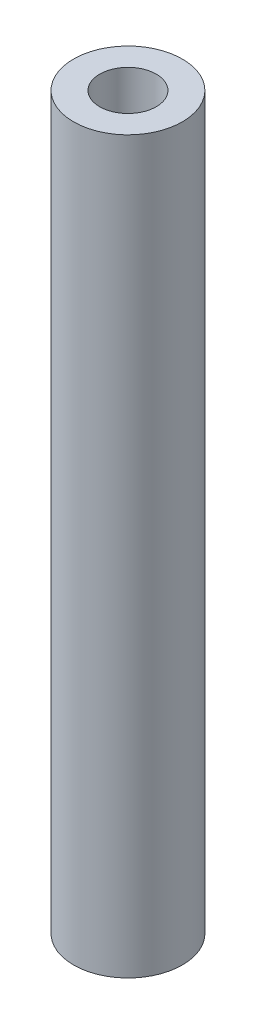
from build123d import *

# Parameters (mm, degrees)
SKETCH1_R           = 6.35
SKETCH1_R_2         = 3.302
BOSS_EXTRUDE1_DEPTH = 85.217


with BuildPart() as part:
    # Sketch1 → Boss-Extrude1 (new body)
    with BuildSketch(Plane(origin=(0, 0, 0), x_dir=(1, 0, 0), z_dir=(0, 1, 0))):
        with Locations(Location((0, 0, 0), (0, 0, 270))):
            Circle(SKETCH1_R)
        with Locations(Location((0, 0, 0), (0, 0, 270))):
            Circle(SKETCH1_R_2, mode=Mode.SUBTRACT)
    extrude(amount=BOSS_EXTRUDE1_DEPTH)


solid = part.part
